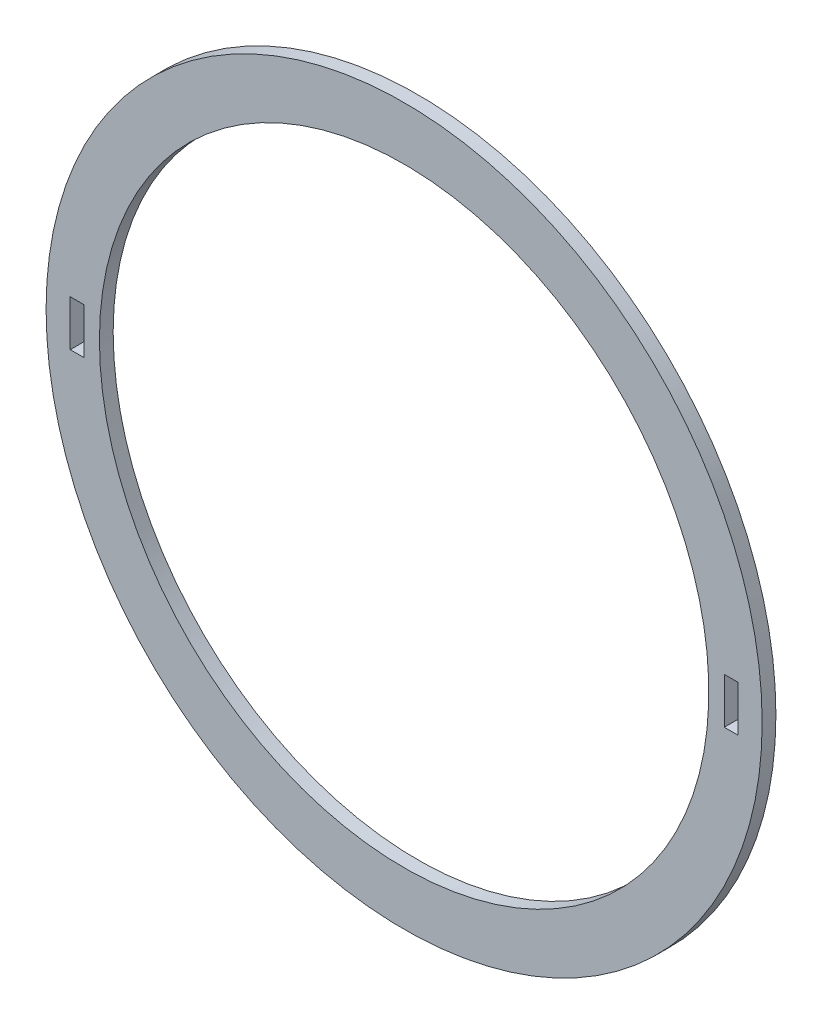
ISO-10303-21;
HEADER;
FILE_DESCRIPTION(('STEP AP214'),'2;1');
FILE_NAME('part.step','',(''),(''),'','','');
FILE_SCHEMA(('AUTOMOTIVE_DESIGN { 1 0 10303 214 1 1 1 1 }'));
ENDSEC;
DATA;
#1=APPLICATION_CONTEXT('core data for automotive mechanical design processes');
#2=APPLICATION_PROTOCOL_DEFINITION('international standard','automotive_design',2000,#1);
#3=PRODUCT_CONTEXT('',#1,'mechanical');
#4=PRODUCT('Part','Part','',(#3));
#5=PRODUCT_RELATED_PRODUCT_CATEGORY('part','',(#4));
#6=PRODUCT_DEFINITION_FORMATION('','',#4);
#7=PRODUCT_DEFINITION_CONTEXT('part definition',#1,'design');
#8=PRODUCT_DEFINITION('design','',#6,#7);
#9=PRODUCT_DEFINITION_SHAPE('','',#8);
#10=(LENGTH_UNIT() NAMED_UNIT(*) SI_UNIT(.MILLI.,.METRE.));
#11=(NAMED_UNIT(*) PLANE_ANGLE_UNIT() SI_UNIT($,.RADIAN.));
#12=(NAMED_UNIT(*) SI_UNIT($,.STERADIAN.) SOLID_ANGLE_UNIT());
#13=UNCERTAINTY_MEASURE_WITH_UNIT(LENGTH_MEASURE(1.E-05),#10,'distance_accuracy_value','');
#14=(GEOMETRIC_REPRESENTATION_CONTEXT(3) GLOBAL_UNCERTAINTY_ASSIGNED_CONTEXT((#13)) GLOBAL_UNIT_ASSIGNED_CONTEXT((#10,
#11,#12)) REPRESENTATION_CONTEXT('',''));
#15=CARTESIAN_POINT('',(0.,0.,0.));
#16=DIRECTION('',(0.,0.,1.));
#17=DIRECTION('',(1.,0.,0.));
#18=AXIS2_PLACEMENT_3D('',#15,#16,#17);
#19=CARTESIAN_POINT('',(0.,25.141193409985,1.524));
#20=DIRECTION('',(0.,0.,1.));
#21=DIRECTION('',(1.,0.,0.));
#22=AXIS2_PLACEMENT_3D('',#19,#20,#21);
#23=PLANE('',#22);
#24=CARTESIAN_POINT('',(0.,25.141193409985,1.524));
#25=DIRECTION('',(0.,0.,1.));
#26=DIRECTION('',(1.,0.,0.));
#27=AXIS2_PLACEMENT_3D('',#24,#25,#26);
#28=CIRCLE('',#27,33.7768673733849);
#29=CARTESIAN_POINT('',(-33.7768673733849,25.141193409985,1.524));
#30=VERTEX_POINT('',#29);
#31=EDGE_CURVE('E135',#30,#30,#28,.T.);
#32=ORIENTED_EDGE('',*,*,#31,.F.);
#33=EDGE_LOOP('',(#32));
#34=FACE_BOUND('',#33,.T.);
#35=CARTESIAN_POINT('',(0.,25.141193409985,1.524));
#36=DIRECTION('',(0.,0.,1.));
#37=DIRECTION('',(1.,0.,0.));
#38=AXIS2_PLACEMENT_3D('',#35,#36,#37);
#39=CIRCLE('',#38,39.6875);
#40=CARTESIAN_POINT('',(-39.6875,25.141193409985,1.524));
#41=VERTEX_POINT('',#40);
#42=EDGE_CURVE('E11',#41,#41,#39,.T.);
#43=ORIENTED_EDGE('',*,*,#42,.T.);
#44=EDGE_LOOP('',(#43));
#45=FACE_BOUND('',#44,.T.);
#46=DIRECTION('',(-1.,0.,0.));
#47=VECTOR('',#46,1.);
#48=CARTESIAN_POINT('',(37.0095439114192,27.681193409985,1.524));
#49=LINE('',#48,#47);
#50=CARTESIAN_POINT('',(37.0095439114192,27.681193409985,1.524));
#51=VERTEX_POINT('',#50);
#52=CARTESIAN_POINT('',(35.4855439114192,27.681193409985,1.524));
#53=VERTEX_POINT('',#52);
#54=EDGE_CURVE('E143',#51,#53,#49,.T.);
#55=ORIENTED_EDGE('',*,*,#54,.F.);
#56=DIRECTION('',(0.,1.,0.));
#57=VECTOR('',#56,1.);
#58=CARTESIAN_POINT('',(37.0095439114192,27.681193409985,1.524));
#59=LINE('',#58,#57);
#60=CARTESIAN_POINT('',(37.0095439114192,22.601193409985,1.524));
#61=VERTEX_POINT('',#60);
#62=EDGE_CURVE('E141',#61,#51,#59,.T.);
#63=ORIENTED_EDGE('',*,*,#62,.F.);
#64=DIRECTION('',(1.,0.,0.));
#65=VECTOR('',#64,1.);
#66=CARTESIAN_POINT('',(37.0095439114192,22.601193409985,1.524));
#67=LINE('',#66,#65);
#68=CARTESIAN_POINT('',(35.4855439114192,22.601193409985,1.524));
#69=VERTEX_POINT('',#68);
#70=EDGE_CURVE('E149',#69,#61,#67,.T.);
#71=ORIENTED_EDGE('',*,*,#70,.F.);
#72=DIRECTION('',(0.,-1.,0.));
#73=VECTOR('',#72,1.);
#74=CARTESIAN_POINT('',(35.4855439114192,27.681193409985,1.524));
#75=LINE('',#74,#73);
#76=EDGE_CURVE('E146',#53,#69,#75,.T.);
#77=ORIENTED_EDGE('',*,*,#76,.F.);
#78=EDGE_LOOP('',(#55,#63,#71,#77));
#79=FACE_BOUND('',#78,.T.);
#80=DIRECTION('',(0.,-1.,0.));
#81=VECTOR('',#80,1.);
#82=CARTESIAN_POINT('',(-37.0095439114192,27.681193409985,1.524));
#83=LINE('',#82,#81);
#84=CARTESIAN_POINT('',(-37.0095439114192,27.681193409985,1.524));
#85=VERTEX_POINT('',#84);
#86=CARTESIAN_POINT('',(-37.0095439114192,22.601193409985,1.524));
#87=VERTEX_POINT('',#86);
#88=EDGE_CURVE('E107',#85,#87,#83,.T.);
#89=ORIENTED_EDGE('',*,*,#88,.F.);
#90=DIRECTION('',(-1.,0.,0.));
#91=VECTOR('',#90,1.);
#92=CARTESIAN_POINT('',(-37.0095439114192,27.681193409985,1.524));
#93=LINE('',#92,#91);
#94=CARTESIAN_POINT('',(-35.4855439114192,27.681193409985,1.524));
#95=VERTEX_POINT('',#94);
#96=EDGE_CURVE('E99',#95,#85,#93,.T.);
#97=ORIENTED_EDGE('',*,*,#96,.F.);
#98=DIRECTION('',(0.,1.,0.));
#99=VECTOR('',#98,1.);
#100=CARTESIAN_POINT('',(-35.4855439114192,27.681193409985,1.524));
#101=LINE('',#100,#99);
#102=CARTESIAN_POINT('',(-35.4855439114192,22.601193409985,1.524));
#103=VERTEX_POINT('',#102);
#104=EDGE_CURVE('E121',#103,#95,#101,.T.);
#105=ORIENTED_EDGE('',*,*,#104,.F.);
#106=DIRECTION('',(1.,0.,0.));
#107=VECTOR('',#106,1.);
#108=CARTESIAN_POINT('',(-37.0095439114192,22.601193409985,1.524));
#109=LINE('',#108,#107);
#110=EDGE_CURVE('E119',#87,#103,#109,.T.);
#111=ORIENTED_EDGE('',*,*,#110,.F.);
#112=EDGE_LOOP('',(#89,#97,#105,#111));
#113=FACE_BOUND('',#112,.T.);
#114=ADVANCED_FACE('F34',(#34,#45,#79,#113),#23,.T.);
#115=CARTESIAN_POINT('',(0.,25.141193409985,0.));
#116=DIRECTION('',(0.,0.,1.));
#117=DIRECTION('',(1.,0.,0.));
#118=AXIS2_PLACEMENT_3D('',#115,#116,#117);
#119=PLANE('',#118);
#120=CARTESIAN_POINT('',(0.,25.141193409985,0.));
#121=DIRECTION('',(0.,0.,1.));
#122=DIRECTION('',(1.,0.,0.));
#123=AXIS2_PLACEMENT_3D('',#120,#121,#122);
#124=CIRCLE('',#123,33.7768673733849);
#125=CARTESIAN_POINT('',(-33.7768673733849,25.141193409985,0.));
#126=VERTEX_POINT('',#125);
#127=EDGE_CURVE('E115',#126,#126,#124,.T.);
#128=ORIENTED_EDGE('',*,*,#127,.T.);
#129=EDGE_LOOP('',(#128));
#130=FACE_BOUND('',#129,.T.);
#131=CARTESIAN_POINT('',(0.,25.141193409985,0.));
#132=DIRECTION('',(0.,0.,1.));
#133=DIRECTION('',(1.,0.,0.));
#134=AXIS2_PLACEMENT_3D('',#131,#132,#133);
#135=CIRCLE('',#134,39.6875);
#136=CARTESIAN_POINT('',(-39.6875,25.141193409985,0.));
#137=VERTEX_POINT('',#136);
#138=EDGE_CURVE('E38',#137,#137,#135,.T.);
#139=ORIENTED_EDGE('',*,*,#138,.F.);
#140=EDGE_LOOP('',(#139));
#141=FACE_BOUND('',#140,.T.);
#142=DIRECTION('',(0.,1.,0.));
#143=VECTOR('',#142,1.);
#144=CARTESIAN_POINT('',(37.0095439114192,27.681193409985,0.));
#145=LINE('',#144,#143);
#146=CARTESIAN_POINT('',(37.0095439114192,22.601193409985,0.));
#147=VERTEX_POINT('',#146);
#148=CARTESIAN_POINT('',(37.0095439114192,27.681193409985,0.));
#149=VERTEX_POINT('',#148);
#150=EDGE_CURVE('E138',#147,#149,#145,.T.);
#151=ORIENTED_EDGE('',*,*,#150,.T.);
#152=DIRECTION('',(-1.,0.,0.));
#153=VECTOR('',#152,1.);
#154=CARTESIAN_POINT('',(37.0095439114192,27.681193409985,0.));
#155=LINE('',#154,#153);
#156=CARTESIAN_POINT('',(35.4855439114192,27.681193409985,0.));
#157=VERTEX_POINT('',#156);
#158=EDGE_CURVE('E154',#149,#157,#155,.T.);
#159=ORIENTED_EDGE('',*,*,#158,.T.);
#160=DIRECTION('',(0.,-1.,0.));
#161=VECTOR('',#160,1.);
#162=CARTESIAN_POINT('',(35.4855439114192,27.681193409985,0.));
#163=LINE('',#162,#161);
#164=CARTESIAN_POINT('',(35.4855439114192,22.601193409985,0.));
#165=VERTEX_POINT('',#164);
#166=EDGE_CURVE('E157',#157,#165,#163,.T.);
#167=ORIENTED_EDGE('',*,*,#166,.T.);
#168=DIRECTION('',(1.,0.,0.));
#169=VECTOR('',#168,1.);
#170=CARTESIAN_POINT('',(37.0095439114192,22.601193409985,0.));
#171=LINE('',#170,#169);
#172=EDGE_CURVE('E144',#165,#147,#171,.T.);
#173=ORIENTED_EDGE('',*,*,#172,.T.);
#174=EDGE_LOOP('',(#151,#159,#167,#173));
#175=FACE_BOUND('',#174,.T.);
#176=DIRECTION('',(-1.,0.,0.));
#177=VECTOR('',#176,1.);
#178=CARTESIAN_POINT('',(-37.0095439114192,27.681193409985,0.));
#179=LINE('',#178,#177);
#180=CARTESIAN_POINT('',(-35.4855439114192,27.681193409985,0.));
#181=VERTEX_POINT('',#180);
#182=CARTESIAN_POINT('',(-37.0095439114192,27.681193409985,0.));
#183=VERTEX_POINT('',#182);
#184=EDGE_CURVE('E57',#181,#183,#179,.T.);
#185=ORIENTED_EDGE('',*,*,#184,.T.);
#186=DIRECTION('',(0.,-1.,0.));
#187=VECTOR('',#186,1.);
#188=CARTESIAN_POINT('',(-37.0095439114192,27.681193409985,0.));
#189=LINE('',#188,#187);
#190=CARTESIAN_POINT('',(-37.0095439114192,22.601193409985,0.));
#191=VERTEX_POINT('',#190);
#192=EDGE_CURVE('E114',#183,#191,#189,.T.);
#193=ORIENTED_EDGE('',*,*,#192,.T.);
#194=DIRECTION('',(1.,0.,0.));
#195=VECTOR('',#194,1.);
#196=CARTESIAN_POINT('',(-37.0095439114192,22.601193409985,0.));
#197=LINE('',#196,#195);
#198=CARTESIAN_POINT('',(-35.4855439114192,22.601193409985,0.));
#199=VERTEX_POINT('',#198);
#200=EDGE_CURVE('E127',#191,#199,#197,.T.);
#201=ORIENTED_EDGE('',*,*,#200,.T.);
#202=DIRECTION('',(0.,1.,0.));
#203=VECTOR('',#202,1.);
#204=CARTESIAN_POINT('',(-35.4855439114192,27.681193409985,0.));
#205=LINE('',#204,#203);
#206=EDGE_CURVE('E108',#199,#181,#205,.T.);
#207=ORIENTED_EDGE('',*,*,#206,.T.);
#208=EDGE_LOOP('',(#185,#193,#201,#207));
#209=FACE_BOUND('',#208,.T.);
#210=ADVANCED_FACE('F176',(#130,#141,#175,#209),#119,.F.);
#211=CARTESIAN_POINT('',(0.,25.141193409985,1.524));
#212=DIRECTION('',(0.,0.,-1.));
#213=DIRECTION('',(-1.,0.,0.));
#214=AXIS2_PLACEMENT_3D('',#211,#212,#213);
#215=CYLINDRICAL_SURFACE('',#214,39.6875);
#216=CARTESIAN_POINT('',(-39.6875,25.141193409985,1.524));
#217=CARTESIAN_POINT('',(-39.6875,25.141193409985,1.508125));
#218=CARTESIAN_POINT('',(-39.6875,25.141193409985,1.49225));
#219=CARTESIAN_POINT('',(-39.6875,25.141193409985,1.4605));
#220=CARTESIAN_POINT('',(-39.6875,25.141193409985,1.444625));
#221=CARTESIAN_POINT('',(-39.6875,25.141193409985,1.412875));
#222=CARTESIAN_POINT('',(-39.6875,25.141193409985,1.397));
#223=CARTESIAN_POINT('',(-39.6875,25.141193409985,1.36525));
#224=CARTESIAN_POINT('',(-39.6875,25.141193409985,1.349375));
#225=CARTESIAN_POINT('',(-39.6875,25.141193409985,1.317625));
#226=CARTESIAN_POINT('',(-39.6875,25.141193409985,1.30175));
#227=CARTESIAN_POINT('',(-39.6875,25.141193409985,1.27));
#228=CARTESIAN_POINT('',(-39.6875,25.141193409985,1.254125));
#229=CARTESIAN_POINT('',(-39.6875,25.141193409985,1.222375));
#230=CARTESIAN_POINT('',(-39.6875,25.141193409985,1.2065));
#231=CARTESIAN_POINT('',(-39.6875,25.141193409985,1.17475));
#232=CARTESIAN_POINT('',(-39.6875,25.141193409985,1.158875));
#233=CARTESIAN_POINT('',(-39.6875,25.141193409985,1.127125));
#234=CARTESIAN_POINT('',(-39.6875,25.141193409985,1.11125));
#235=CARTESIAN_POINT('',(-39.6875,25.141193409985,1.0795));
#236=CARTESIAN_POINT('',(-39.6875,25.141193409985,1.063625));
#237=CARTESIAN_POINT('',(-39.6875,25.141193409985,1.031875));
#238=CARTESIAN_POINT('',(-39.6875,25.141193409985,1.016));
#239=CARTESIAN_POINT('',(-39.6875,25.141193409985,0.98425));
#240=CARTESIAN_POINT('',(-39.6875,25.141193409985,0.968375));
#241=CARTESIAN_POINT('',(-39.6875,25.141193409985,0.936625));
#242=CARTESIAN_POINT('',(-39.6875,25.141193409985,0.92075));
#243=CARTESIAN_POINT('',(-39.6875,25.141193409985,0.889));
#244=CARTESIAN_POINT('',(-39.6875,25.141193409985,0.873125));
#245=CARTESIAN_POINT('',(-39.6875,25.141193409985,0.841375));
#246=CARTESIAN_POINT('',(-39.6875,25.141193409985,0.8255));
#247=CARTESIAN_POINT('',(-39.6875,25.141193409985,0.79375));
#248=CARTESIAN_POINT('',(-39.6875,25.141193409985,0.777875));
#249=CARTESIAN_POINT('',(-39.6875,25.141193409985,0.746125));
#250=CARTESIAN_POINT('',(-39.6875,25.141193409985,0.73025));
#251=CARTESIAN_POINT('',(-39.6875,25.141193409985,0.6985));
#252=CARTESIAN_POINT('',(-39.6875,25.141193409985,0.682625));
#253=CARTESIAN_POINT('',(-39.6875,25.141193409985,0.650875));
#254=CARTESIAN_POINT('',(-39.6875,25.141193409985,0.635));
#255=CARTESIAN_POINT('',(-39.6875,25.141193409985,0.60325));
#256=CARTESIAN_POINT('',(-39.6875,25.141193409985,0.587375));
#257=CARTESIAN_POINT('',(-39.6875,25.141193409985,0.555625));
#258=CARTESIAN_POINT('',(-39.6875,25.141193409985,0.53975));
#259=CARTESIAN_POINT('',(-39.6875,25.141193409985,0.508));
#260=CARTESIAN_POINT('',(-39.6875,25.141193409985,0.492125));
#261=CARTESIAN_POINT('',(-39.6875,25.141193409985,0.460375));
#262=CARTESIAN_POINT('',(-39.6875,25.141193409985,0.4445));
#263=CARTESIAN_POINT('',(-39.6875,25.141193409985,0.41275));
#264=CARTESIAN_POINT('',(-39.6875,25.141193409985,0.396875));
#265=CARTESIAN_POINT('',(-39.6875,25.141193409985,0.365125));
#266=CARTESIAN_POINT('',(-39.6875,25.141193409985,0.34925));
#267=CARTESIAN_POINT('',(-39.6875,25.141193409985,0.3175));
#268=CARTESIAN_POINT('',(-39.6875,25.141193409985,0.301625));
#269=CARTESIAN_POINT('',(-39.6875,25.141193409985,0.269875));
#270=CARTESIAN_POINT('',(-39.6875,25.141193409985,0.254));
#271=CARTESIAN_POINT('',(-39.6875,25.141193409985,0.22225));
#272=CARTESIAN_POINT('',(-39.6875,25.141193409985,0.206375));
#273=CARTESIAN_POINT('',(-39.6875,25.141193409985,0.174625));
#274=CARTESIAN_POINT('',(-39.6875,25.141193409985,0.15875));
#275=CARTESIAN_POINT('',(-39.6875,25.141193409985,0.127));
#276=CARTESIAN_POINT('',(-39.6875,25.141193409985,0.111125));
#277=CARTESIAN_POINT('',(-39.6875,25.141193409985,0.079375));
#278=CARTESIAN_POINT('',(-39.6875,25.141193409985,0.0635));
#279=CARTESIAN_POINT('',(-39.6875,25.141193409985,0.0317499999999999));
#280=CARTESIAN_POINT('',(-39.6875,25.141193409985,0.015875));
#281=CARTESIAN_POINT('',(-39.6875,25.141193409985,0.));
#282=B_SPLINE_CURVE_WITH_KNOTS('',3,(#216,#217,#218,#219,#220,#221,#222,#223,#224,#225,#226,
#227,#228,#229,#230,#231,#232,#233,#234,#235,#236,#237,#238,#239,#240,#241,#242,#243,#244,#245,
#246,#247,#248,#249,#250,#251,#252,#253,#254,#255,#256,#257,#258,#259,#260,#261,#262,#263,#264,
#265,#266,#267,#268,#269,#270,#271,#272,#273,#274,#275,#276,#277,#278,#279,#280,#281),
.UNSPECIFIED.,.F.,.F.,(4,2,2,2,2,2,2,2,2,2,2,2,2,2,2,2,2,2,2,2,2,2,2,2,2,2,2,2,2,2,2,2,4),(0.,
0.0476250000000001,0.0952500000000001,0.142875,0.1905,0.238125,0.28575,0.333375,0.381,0.428625,
0.47625,0.523875,0.5715,0.619125,0.66675,0.714375,0.762,0.809625,0.85725,0.904875,0.9525,
1.000125,1.04775,1.095375,1.143,1.190625,1.23825,1.285875,1.3335,1.381125,1.42875,1.476375,
1.524),.UNSPECIFIED.);
#283=EDGE_CURVE('BSEAM36',#41,#137,#282,.T.);
#284=ORIENTED_EDGE('',*,*,#42,.F.);
#285=ORIENTED_EDGE('',*,*,#138,.T.);
#286=ORIENTED_EDGE('',*,*,#283,.T.);
#287=ORIENTED_EDGE('',*,*,#283,.F.);
#288=EDGE_LOOP('',(#284,#286,#285,#287));
#289=FACE_BOUND('',#288,.T.);
#290=ADVANCED_FACE('F36',(#289),#215,.T.);
#291=CARTESIAN_POINT('',(37.0095439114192,27.681193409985,1.524));
#292=DIRECTION('',(-1.,0.,0.));
#293=DIRECTION('',(0.,0.,1.));
#294=AXIS2_PLACEMENT_3D('',#291,#292,#293);
#295=PLANE('',#294);
#296=ORIENTED_EDGE('',*,*,#150,.F.);
#297=DIRECTION('',(0.,0.,-1.));
#298=VECTOR('',#297,1.);
#299=CARTESIAN_POINT('',(37.0095439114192,22.601193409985,1.524));
#300=LINE('',#299,#298);
#301=EDGE_CURVE('E151',#61,#147,#300,.T.);
#302=ORIENTED_EDGE('',*,*,#301,.F.);
#303=ORIENTED_EDGE('',*,*,#62,.T.);
#304=DIRECTION('',(0.,0.,-1.));
#305=VECTOR('',#304,1.);
#306=CARTESIAN_POINT('',(37.0095439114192,27.681193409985,1.524));
#307=LINE('',#306,#305);
#308=EDGE_CURVE('E168',#51,#149,#307,.T.);
#309=ORIENTED_EDGE('',*,*,#308,.T.);
#310=EDGE_LOOP('',(#296,#302,#303,#309));
#311=FACE_BOUND('',#310,.T.);
#312=ADVANCED_FACE('F199',(#311),#295,.T.);
#313=CARTESIAN_POINT('',(37.0095439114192,27.681193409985,1.524));
#314=DIRECTION('',(0.,-1.,0.));
#315=DIRECTION('',(0.,0.,-1.));
#316=AXIS2_PLACEMENT_3D('',#313,#314,#315);
#317=PLANE('',#316);
#318=ORIENTED_EDGE('',*,*,#158,.F.);
#319=ORIENTED_EDGE('',*,*,#308,.F.);
#320=ORIENTED_EDGE('',*,*,#54,.T.);
#321=DIRECTION('',(0.,0.,-1.));
#322=VECTOR('',#321,1.);
#323=CARTESIAN_POINT('',(35.4855439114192,27.681193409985,1.524));
#324=LINE('',#323,#322);
#325=EDGE_CURVE('E166',#53,#157,#324,.T.);
#326=ORIENTED_EDGE('',*,*,#325,.T.);
#327=EDGE_LOOP('',(#318,#319,#320,#326));
#328=FACE_BOUND('',#327,.T.);
#329=ADVANCED_FACE('F202',(#328),#317,.T.);
#330=CARTESIAN_POINT('',(35.4855439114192,27.681193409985,1.524));
#331=DIRECTION('',(1.,0.,0.));
#332=DIRECTION('',(0.,0.,-1.));
#333=AXIS2_PLACEMENT_3D('',#330,#331,#332);
#334=PLANE('',#333);
#335=ORIENTED_EDGE('',*,*,#166,.F.);
#336=ORIENTED_EDGE('',*,*,#325,.F.);
#337=ORIENTED_EDGE('',*,*,#76,.T.);
#338=DIRECTION('',(0.,0.,-1.));
#339=VECTOR('',#338,1.);
#340=CARTESIAN_POINT('',(35.4855439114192,22.601193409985,1.524));
#341=LINE('',#340,#339);
#342=EDGE_CURVE('E164',#69,#165,#341,.T.);
#343=ORIENTED_EDGE('',*,*,#342,.T.);
#344=EDGE_LOOP('',(#335,#336,#337,#343));
#345=FACE_BOUND('',#344,.T.);
#346=ADVANCED_FACE('F205',(#345),#334,.T.);
#347=CARTESIAN_POINT('',(37.0095439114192,22.601193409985,1.524));
#348=DIRECTION('',(0.,1.,0.));
#349=DIRECTION('',(0.,0.,1.));
#350=AXIS2_PLACEMENT_3D('',#347,#348,#349);
#351=PLANE('',#350);
#352=ORIENTED_EDGE('',*,*,#172,.F.);
#353=ORIENTED_EDGE('',*,*,#342,.F.);
#354=ORIENTED_EDGE('',*,*,#70,.T.);
#355=ORIENTED_EDGE('',*,*,#301,.T.);
#356=EDGE_LOOP('',(#352,#353,#354,#355));
#357=FACE_BOUND('',#356,.T.);
#358=ADVANCED_FACE('F209',(#357),#351,.T.);
#359=CARTESIAN_POINT('',(0.,25.141193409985,1.524));
#360=DIRECTION('',(0.,0.,-1.));
#361=DIRECTION('',(-1.,0.,0.));
#362=AXIS2_PLACEMENT_3D('',#359,#360,#361);
#363=CYLINDRICAL_SURFACE('',#362,33.7768673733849);
#364=CARTESIAN_POINT('',(-33.7768673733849,25.141193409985,1.524));
#365=CARTESIAN_POINT('',(-33.7768673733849,25.141193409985,1.508125));
#366=CARTESIAN_POINT('',(-33.7768673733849,25.141193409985,1.49225));
#367=CARTESIAN_POINT('',(-33.7768673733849,25.141193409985,1.4605));
#368=CARTESIAN_POINT('',(-33.7768673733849,25.141193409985,1.444625));
#369=CARTESIAN_POINT('',(-33.7768673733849,25.141193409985,1.412875));
#370=CARTESIAN_POINT('',(-33.7768673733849,25.141193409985,1.397));
#371=CARTESIAN_POINT('',(-33.7768673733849,25.141193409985,1.36525));
#372=CARTESIAN_POINT('',(-33.7768673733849,25.141193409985,1.349375));
#373=CARTESIAN_POINT('',(-33.7768673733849,25.141193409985,1.317625));
#374=CARTESIAN_POINT('',(-33.7768673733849,25.141193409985,1.30175));
#375=CARTESIAN_POINT('',(-33.7768673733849,25.141193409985,1.27));
#376=CARTESIAN_POINT('',(-33.7768673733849,25.141193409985,1.254125));
#377=CARTESIAN_POINT('',(-33.7768673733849,25.141193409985,1.222375));
#378=CARTESIAN_POINT('',(-33.7768673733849,25.141193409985,1.2065));
#379=CARTESIAN_POINT('',(-33.7768673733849,25.141193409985,1.17475));
#380=CARTESIAN_POINT('',(-33.7768673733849,25.141193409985,1.158875));
#381=CARTESIAN_POINT('',(-33.7768673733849,25.141193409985,1.127125));
#382=CARTESIAN_POINT('',(-33.7768673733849,25.141193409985,1.11125));
#383=CARTESIAN_POINT('',(-33.7768673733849,25.141193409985,1.0795));
#384=CARTESIAN_POINT('',(-33.7768673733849,25.141193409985,1.063625));
#385=CARTESIAN_POINT('',(-33.7768673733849,25.141193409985,1.031875));
#386=CARTESIAN_POINT('',(-33.7768673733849,25.141193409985,1.016));
#387=CARTESIAN_POINT('',(-33.7768673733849,25.141193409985,0.98425));
#388=CARTESIAN_POINT('',(-33.7768673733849,25.141193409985,0.968375));
#389=CARTESIAN_POINT('',(-33.7768673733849,25.141193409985,0.936625));
#390=CARTESIAN_POINT('',(-33.7768673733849,25.141193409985,0.92075));
#391=CARTESIAN_POINT('',(-33.7768673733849,25.141193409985,0.889));
#392=CARTESIAN_POINT('',(-33.7768673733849,25.141193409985,0.873125));
#393=CARTESIAN_POINT('',(-33.7768673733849,25.141193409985,0.841375));
#394=CARTESIAN_POINT('',(-33.7768673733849,25.141193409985,0.8255));
#395=CARTESIAN_POINT('',(-33.7768673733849,25.141193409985,0.79375));
#396=CARTESIAN_POINT('',(-33.7768673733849,25.141193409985,0.777875));
#397=CARTESIAN_POINT('',(-33.7768673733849,25.141193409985,0.746125));
#398=CARTESIAN_POINT('',(-33.7768673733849,25.141193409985,0.73025));
#399=CARTESIAN_POINT('',(-33.7768673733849,25.141193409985,0.6985));
#400=CARTESIAN_POINT('',(-33.7768673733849,25.141193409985,0.682625));
#401=CARTESIAN_POINT('',(-33.7768673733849,25.141193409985,0.650875));
#402=CARTESIAN_POINT('',(-33.7768673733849,25.141193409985,0.635));
#403=CARTESIAN_POINT('',(-33.7768673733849,25.141193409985,0.60325));
#404=CARTESIAN_POINT('',(-33.7768673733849,25.141193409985,0.587375));
#405=CARTESIAN_POINT('',(-33.7768673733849,25.141193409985,0.555625));
#406=CARTESIAN_POINT('',(-33.7768673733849,25.141193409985,0.53975));
#407=CARTESIAN_POINT('',(-33.7768673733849,25.141193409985,0.508));
#408=CARTESIAN_POINT('',(-33.7768673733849,25.141193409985,0.492125));
#409=CARTESIAN_POINT('',(-33.7768673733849,25.141193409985,0.460375));
#410=CARTESIAN_POINT('',(-33.7768673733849,25.141193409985,0.4445));
#411=CARTESIAN_POINT('',(-33.7768673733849,25.141193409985,0.41275));
#412=CARTESIAN_POINT('',(-33.7768673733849,25.141193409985,0.396875));
#413=CARTESIAN_POINT('',(-33.7768673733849,25.141193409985,0.365125));
#414=CARTESIAN_POINT('',(-33.7768673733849,25.141193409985,0.34925));
#415=CARTESIAN_POINT('',(-33.7768673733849,25.141193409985,0.3175));
#416=CARTESIAN_POINT('',(-33.7768673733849,25.141193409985,0.301625));
#417=CARTESIAN_POINT('',(-33.7768673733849,25.141193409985,0.269875));
#418=CARTESIAN_POINT('',(-33.7768673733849,25.141193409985,0.254));
#419=CARTESIAN_POINT('',(-33.7768673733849,25.141193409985,0.22225));
#420=CARTESIAN_POINT('',(-33.7768673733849,25.141193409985,0.206375));
#421=CARTESIAN_POINT('',(-33.7768673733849,25.141193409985,0.174625));
#422=CARTESIAN_POINT('',(-33.7768673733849,25.141193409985,0.15875));
#423=CARTESIAN_POINT('',(-33.7768673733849,25.141193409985,0.127));
#424=CARTESIAN_POINT('',(-33.7768673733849,25.141193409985,0.111125));
#425=CARTESIAN_POINT('',(-33.7768673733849,25.141193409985,0.079375));
#426=CARTESIAN_POINT('',(-33.7768673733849,25.141193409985,0.0635));
#427=CARTESIAN_POINT('',(-33.7768673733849,25.141193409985,0.0317499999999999));
#428=CARTESIAN_POINT('',(-33.7768673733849,25.141193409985,0.015875));
#429=CARTESIAN_POINT('',(-33.7768673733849,25.141193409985,0.));
#430=B_SPLINE_CURVE_WITH_KNOTS('',3,(#364,#365,#366,#367,#368,#369,#370,#371,#372,#373,#374,
#375,#376,#377,#378,#379,#380,#381,#382,#383,#384,#385,#386,#387,#388,#389,#390,#391,#392,#393,
#394,#395,#396,#397,#398,#399,#400,#401,#402,#403,#404,#405,#406,#407,#408,#409,#410,#411,#412,
#413,#414,#415,#416,#417,#418,#419,#420,#421,#422,#423,#424,#425,#426,#427,#428,#429),
.UNSPECIFIED.,.F.,.F.,(4,2,2,2,2,2,2,2,2,2,2,2,2,2,2,2,2,2,2,2,2,2,2,2,2,2,2,2,2,2,2,2,4),(0.,
0.0476250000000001,0.0952500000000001,0.142875,0.1905,0.238125,0.28575,0.333375,0.381,0.428625,
0.47625,0.523875,0.5715,0.619125,0.66675,0.714375,0.762,0.809625,0.85725,0.904875,0.9525,
1.000125,1.04775,1.095375,1.143,1.190625,1.23825,1.285875,1.3335,1.381125,1.42875,1.476375,
1.524),.UNSPECIFIED.);
#431=EDGE_CURVE('BSEAM213',#30,#126,#430,.T.);
#432=ORIENTED_EDGE('',*,*,#31,.T.);
#433=ORIENTED_EDGE('',*,*,#127,.F.);
#434=ORIENTED_EDGE('',*,*,#431,.T.);
#435=ORIENTED_EDGE('',*,*,#431,.F.);
#436=EDGE_LOOP('',(#432,#434,#433,#435));
#437=FACE_BOUND('',#436,.T.);
#438=ADVANCED_FACE('F213',(#437),#363,.F.);
#439=CARTESIAN_POINT('',(-37.0095439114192,27.681193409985,1.524));
#440=DIRECTION('',(0.,-1.,0.));
#441=DIRECTION('',(0.,0.,-1.));
#442=AXIS2_PLACEMENT_3D('',#439,#440,#441);
#443=PLANE('',#442);
#444=ORIENTED_EDGE('',*,*,#184,.F.);
#445=DIRECTION('',(0.,0.,-1.));
#446=VECTOR('',#445,1.);
#447=CARTESIAN_POINT('',(-35.4855439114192,27.681193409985,1.524));
#448=LINE('',#447,#446);
#449=EDGE_CURVE('E103',#95,#181,#448,.T.);
#450=ORIENTED_EDGE('',*,*,#449,.F.);
#451=ORIENTED_EDGE('',*,*,#96,.T.);
#452=DIRECTION('',(0.,0.,-1.));
#453=VECTOR('',#452,1.);
#454=CARTESIAN_POINT('',(-37.0095439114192,27.681193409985,1.524));
#455=LINE('',#454,#453);
#456=EDGE_CURVE('E102',#85,#183,#455,.T.);
#457=ORIENTED_EDGE('',*,*,#456,.T.);
#458=EDGE_LOOP('',(#444,#450,#451,#457));
#459=FACE_BOUND('',#458,.T.);
#460=ADVANCED_FACE('F101',(#459),#443,.T.);
#461=CARTESIAN_POINT('',(-37.0095439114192,27.681193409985,1.524));
#462=DIRECTION('',(1.,0.,0.));
#463=DIRECTION('',(0.,0.,-1.));
#464=AXIS2_PLACEMENT_3D('',#461,#462,#463);
#465=PLANE('',#464);
#466=ORIENTED_EDGE('',*,*,#192,.F.);
#467=ORIENTED_EDGE('',*,*,#456,.F.);
#468=ORIENTED_EDGE('',*,*,#88,.T.);
#469=DIRECTION('',(0.,0.,-1.));
#470=VECTOR('',#469,1.);
#471=CARTESIAN_POINT('',(-37.0095439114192,22.601193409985,1.524));
#472=LINE('',#471,#470);
#473=EDGE_CURVE('E116',#87,#191,#472,.T.);
#474=ORIENTED_EDGE('',*,*,#473,.T.);
#475=EDGE_LOOP('',(#466,#467,#468,#474));
#476=FACE_BOUND('',#475,.T.);
#477=ADVANCED_FACE('F111',(#476),#465,.T.);
#478=CARTESIAN_POINT('',(-37.0095439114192,22.601193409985,1.524));
#479=DIRECTION('',(0.,1.,0.));
#480=DIRECTION('',(0.,0.,1.));
#481=AXIS2_PLACEMENT_3D('',#478,#479,#480);
#482=PLANE('',#481);
#483=ORIENTED_EDGE('',*,*,#200,.F.);
#484=ORIENTED_EDGE('',*,*,#473,.F.);
#485=ORIENTED_EDGE('',*,*,#110,.T.);
#486=DIRECTION('',(0.,0.,-1.));
#487=VECTOR('',#486,1.);
#488=CARTESIAN_POINT('',(-35.4855439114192,22.601193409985,1.524));
#489=LINE('',#488,#487);
#490=EDGE_CURVE('E49',#103,#199,#489,.T.);
#491=ORIENTED_EDGE('',*,*,#490,.T.);
#492=EDGE_LOOP('',(#483,#484,#485,#491));
#493=FACE_BOUND('',#492,.T.);
#494=ADVANCED_FACE('F184',(#493),#482,.T.);
#495=CARTESIAN_POINT('',(-35.4855439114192,27.681193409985,1.524));
#496=DIRECTION('',(-1.,0.,0.));
#497=DIRECTION('',(0.,0.,1.));
#498=AXIS2_PLACEMENT_3D('',#495,#496,#497);
#499=PLANE('',#498);
#500=ORIENTED_EDGE('',*,*,#206,.F.);
#501=ORIENTED_EDGE('',*,*,#490,.F.);
#502=ORIENTED_EDGE('',*,*,#104,.T.);
#503=ORIENTED_EDGE('',*,*,#449,.T.);
#504=EDGE_LOOP('',(#500,#501,#502,#503));
#505=FACE_BOUND('',#504,.T.);
#506=ADVANCED_FACE('F182',(#505),#499,.T.);
#507=CLOSED_SHELL('',(#114,#210,#290,#312,#329,#346,#358,#438,#460,#477,#494,#506));
#508=MANIFOLD_SOLID_BREP('B2',#507);
#509=ADVANCED_BREP_SHAPE_REPRESENTATION('',(#18,#508),#14);
#510=SHAPE_DEFINITION_REPRESENTATION(#9,#509);
ENDSEC;
END-ISO-10303-21;
